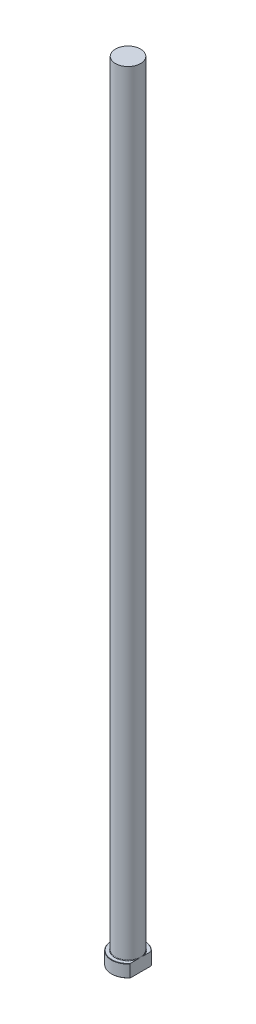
from build123d import *
from build123d.topology import SkipClean

# Parameters (mm, degrees)
CHAMFER1_SIZE    = 0.2
FILLET1_R        = 0.3
KEYED_HEAD_DEPTH = 501.220451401


with BuildPart() as part:
    # Sketch1 → Revolve1 (revolve)
    with BuildSketch(Plane.XY, mode=Mode.PRIVATE) as revolve1_sk:
        Polygon((0, 0), (-10.5, 0), (-10.5, 8), (-8, 8), (-8, 500), (0, 500), align=None)
    revolve(revolve1_sk.sketch.rotate(Axis((0, 259.958771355, 0), (0, -1, 0)), 270), axis=Axis((0, 259.958771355, 0), (0, -1, 0)))

    # Chamfer1
    chamfer1_edges = [part.edges().sort_by_distance(p)[0] for p in [
        (0, 8, -10.5),
        (0, 0, -10.5),
    ]]
    chamfer(chamfer1_edges, length=CHAMFER1_SIZE)

    # Fillet1
    fillet1_edges = [part.edges().sort_by_distance(p)[0] for p in [
        (0, 8, -8),
    ]]
    fillet(fillet1_edges, radius=FILLET1_R)

    # Sketch2 → KEYED HEAD (cut, through all)
    with SkipClean():  # the faces are left unmerged after this step: merging them gives an invalid solid
        with BuildSketch(Plane(origin=(0, 0, 0), x_dir=(1, 0, 0), z_dir=(0, 1, 0))):
            with BuildLine():
                Line((8, -6.800735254), (8, 6.800735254))
                ThreePointArc((8, 6.800735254), (10.5, 0), (8, -6.800735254))
            make_face()
        extrude(amount=KEYED_HEAD_DEPTH, mode=Mode.SUBTRACT)


solid = part.part
